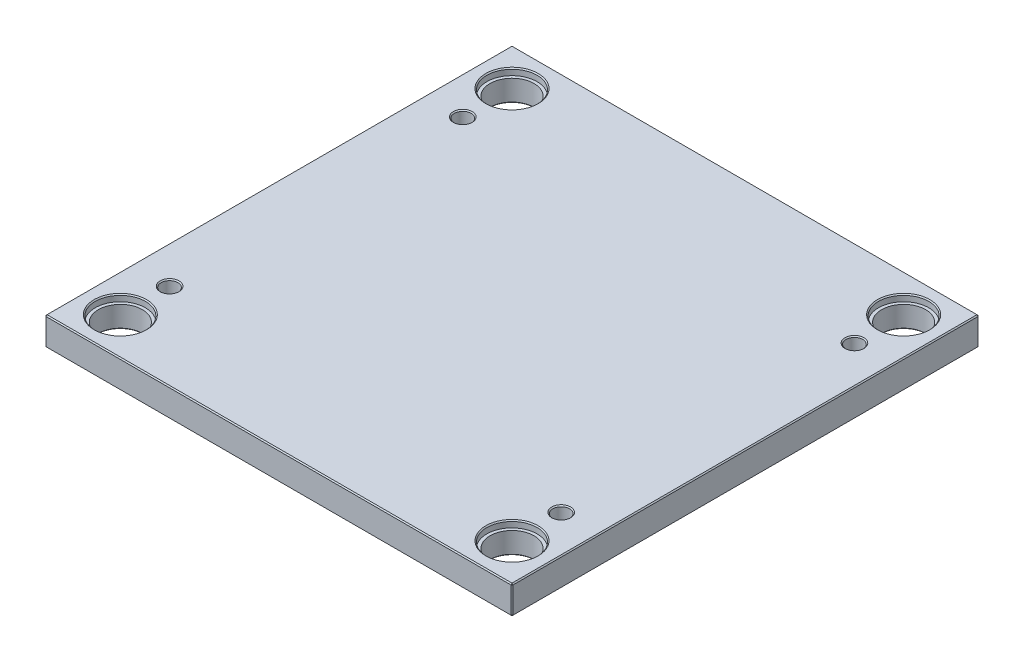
ISO-10303-21;
HEADER;
FILE_DESCRIPTION(('STEP AP214'),'2;1');
FILE_NAME('part.step','',(''),(''),'','','');
FILE_SCHEMA(('AUTOMOTIVE_DESIGN { 1 0 10303 214 1 1 1 1 }'));
ENDSEC;
DATA;
#1=APPLICATION_CONTEXT('core data for automotive mechanical design processes');
#2=APPLICATION_PROTOCOL_DEFINITION('international standard','automotive_design',2000,#1);
#3=PRODUCT_CONTEXT('',#1,'mechanical');
#4=PRODUCT('Part','Part','',(#3));
#5=PRODUCT_RELATED_PRODUCT_CATEGORY('part','',(#4));
#6=PRODUCT_DEFINITION_FORMATION('','',#4);
#7=PRODUCT_DEFINITION_CONTEXT('part definition',#1,'design');
#8=PRODUCT_DEFINITION('design','',#6,#7);
#9=PRODUCT_DEFINITION_SHAPE('','',#8);
#10=(LENGTH_UNIT() NAMED_UNIT(*) SI_UNIT(.MILLI.,.METRE.));
#11=(NAMED_UNIT(*) PLANE_ANGLE_UNIT() SI_UNIT($,.RADIAN.));
#12=(NAMED_UNIT(*) SI_UNIT($,.STERADIAN.) SOLID_ANGLE_UNIT());
#13=UNCERTAINTY_MEASURE_WITH_UNIT(LENGTH_MEASURE(1.E-05),#10,'distance_accuracy_value','');
#14=(GEOMETRIC_REPRESENTATION_CONTEXT(3) GLOBAL_UNCERTAINTY_ASSIGNED_CONTEXT((#13)) GLOBAL_UNIT_ASSIGNED_CONTEXT((#10,
#11,#12)) REPRESENTATION_CONTEXT('',''));
#15=CARTESIAN_POINT('',(0.,0.,0.));
#16=DIRECTION('',(0.,0.,1.));
#17=DIRECTION('',(1.,0.,0.));
#18=AXIS2_PLACEMENT_3D('',#15,#16,#17);
#19=CARTESIAN_POINT('',(-187.,0.,-187.));
#20=DIRECTION('',(0.,1.,0.));
#21=DIRECTION('',(0.,0.,1.));
#22=AXIS2_PLACEMENT_3D('',#19,#20,#21);
#23=CYLINDRICAL_SURFACE('',#22,21.);
#24=CARTESIAN_POINT('',(-187.,1.00000000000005,-187.));
#25=DIRECTION('',(0.,1.,0.));
#26=DIRECTION('',(0.,0.,1.));
#27=AXIS2_PLACEMENT_3D('',#24,#25,#26);
#28=CIRCLE('',#27,21.);
#29=CARTESIAN_POINT('',(-187.,1.00000000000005,-166.));
#30=VERTEX_POINT('',#29);
#31=EDGE_CURVE('E472',#30,#30,#28,.F.);
#32=ORIENTED_EDGE('',*,*,#31,.T.);
#33=EDGE_LOOP('',(#32));
#34=FACE_BOUND('',#33,.T.);
#35=CARTESIAN_POINT('',(-187.,20.7,-187.));
#36=DIRECTION('',(0.,1.,0.));
#37=DIRECTION('',(0.,0.,1.));
#38=AXIS2_PLACEMENT_3D('',#35,#36,#37);
#39=CIRCLE('',#38,21.);
#40=CARTESIAN_POINT('',(-187.,20.7,-166.));
#41=VERTEX_POINT('',#40);
#42=EDGE_CURVE('E221',#41,#41,#39,.F.);
#43=ORIENTED_EDGE('',*,*,#42,.F.);
#44=EDGE_LOOP('',(#43));
#45=FACE_BOUND('',#44,.T.);
#46=ADVANCED_FACE('F16',(#34,#45),#23,.F.);
#47=CARTESIAN_POINT('',(187.,0.,-187.));
#48=DIRECTION('',(0.,1.,0.));
#49=DIRECTION('',(0.,0.,1.));
#50=AXIS2_PLACEMENT_3D('',#47,#48,#49);
#51=CYLINDRICAL_SURFACE('',#50,21.);
#52=CARTESIAN_POINT('',(187.,1.00000000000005,-187.));
#53=DIRECTION('',(0.,1.,0.));
#54=DIRECTION('',(0.,0.,1.));
#55=AXIS2_PLACEMENT_3D('',#52,#53,#54);
#56=CIRCLE('',#55,21.);
#57=CARTESIAN_POINT('',(187.,1.00000000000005,-166.));
#58=VERTEX_POINT('',#57);
#59=EDGE_CURVE('E474',#58,#58,#56,.F.);
#60=ORIENTED_EDGE('',*,*,#59,.T.);
#61=EDGE_LOOP('',(#60));
#62=FACE_BOUND('',#61,.T.);
#63=CARTESIAN_POINT('',(187.,20.7,-187.));
#64=DIRECTION('',(0.,1.,0.));
#65=DIRECTION('',(0.,0.,1.));
#66=AXIS2_PLACEMENT_3D('',#63,#64,#65);
#67=CIRCLE('',#66,21.);
#68=CARTESIAN_POINT('',(187.,20.7,-166.));
#69=VERTEX_POINT('',#68);
#70=EDGE_CURVE('E218',#69,#69,#67,.F.);
#71=ORIENTED_EDGE('',*,*,#70,.F.);
#72=EDGE_LOOP('',(#71));
#73=FACE_BOUND('',#72,.T.);
#74=ADVANCED_FACE('F263',(#62,#73),#51,.F.);
#75=CARTESIAN_POINT('',(187.,0.,187.));
#76=DIRECTION('',(0.,1.,0.));
#77=DIRECTION('',(0.,0.,1.));
#78=AXIS2_PLACEMENT_3D('',#75,#76,#77);
#79=CYLINDRICAL_SURFACE('',#78,21.);
#80=CARTESIAN_POINT('',(187.,1.00000000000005,187.));
#81=DIRECTION('',(0.,1.,0.));
#82=DIRECTION('',(0.,0.,1.));
#83=AXIS2_PLACEMENT_3D('',#80,#81,#82);
#84=CIRCLE('',#83,21.);
#85=CARTESIAN_POINT('',(187.,1.00000000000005,208.));
#86=VERTEX_POINT('',#85);
#87=EDGE_CURVE('E477',#86,#86,#84,.F.);
#88=ORIENTED_EDGE('',*,*,#87,.T.);
#89=EDGE_LOOP('',(#88));
#90=FACE_BOUND('',#89,.T.);
#91=CARTESIAN_POINT('',(187.,20.7,187.));
#92=DIRECTION('',(0.,1.,0.));
#93=DIRECTION('',(0.,0.,1.));
#94=AXIS2_PLACEMENT_3D('',#91,#92,#93);
#95=CIRCLE('',#94,21.);
#96=CARTESIAN_POINT('',(187.,20.7,208.));
#97=VERTEX_POINT('',#96);
#98=EDGE_CURVE('E214',#97,#97,#95,.F.);
#99=ORIENTED_EDGE('',*,*,#98,.F.);
#100=EDGE_LOOP('',(#99));
#101=FACE_BOUND('',#100,.T.);
#102=ADVANCED_FACE('F270',(#90,#101),#79,.F.);
#103=CARTESIAN_POINT('',(-187.,0.,187.));
#104=DIRECTION('',(0.,1.,0.));
#105=DIRECTION('',(0.,0.,1.));
#106=AXIS2_PLACEMENT_3D('',#103,#104,#105);
#107=CYLINDRICAL_SURFACE('',#106,21.);
#108=CARTESIAN_POINT('',(-187.,1.00000000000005,187.));
#109=DIRECTION('',(0.,1.,0.));
#110=DIRECTION('',(0.,0.,1.));
#111=AXIS2_PLACEMENT_3D('',#108,#109,#110);
#112=CIRCLE('',#111,21.);
#113=CARTESIAN_POINT('',(-187.,1.00000000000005,208.));
#114=VERTEX_POINT('',#113);
#115=EDGE_CURVE('E480',#114,#114,#112,.F.);
#116=ORIENTED_EDGE('',*,*,#115,.T.);
#117=EDGE_LOOP('',(#116));
#118=FACE_BOUND('',#117,.T.);
#119=CARTESIAN_POINT('',(-187.,20.7,187.));
#120=DIRECTION('',(0.,1.,0.));
#121=DIRECTION('',(0.,0.,1.));
#122=AXIS2_PLACEMENT_3D('',#119,#120,#121);
#123=CIRCLE('',#122,21.);
#124=CARTESIAN_POINT('',(-187.,20.7,208.));
#125=VERTEX_POINT('',#124);
#126=EDGE_CURVE('E211',#125,#125,#123,.F.);
#127=ORIENTED_EDGE('',*,*,#126,.F.);
#128=EDGE_LOOP('',(#127));
#129=FACE_BOUND('',#128,.T.);
#130=ADVANCED_FACE('F277',(#118,#129),#107,.F.);
#131=CARTESIAN_POINT('',(-223.,27.,223.));
#132=DIRECTION('',(1.,0.,0.));
#133=DIRECTION('',(0.,0.,-1.));
#134=AXIS2_PLACEMENT_3D('',#131,#132,#133);
#135=PLANE('',#134);
#136=DIRECTION('',(0.,-1.,0.));
#137=VECTOR('',#136,1.);
#138=CARTESIAN_POINT('',(-223.,27.,-222.));
#139=LINE('',#138,#137);
#140=CARTESIAN_POINT('',(-223.,26.,-222.));
#141=VERTEX_POINT('',#140);
#142=CARTESIAN_POINT('',(-223.,1.00000000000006,-222.));
#143=VERTEX_POINT('',#142);
#144=EDGE_CURVE('E487',#141,#143,#139,.T.);
#145=ORIENTED_EDGE('',*,*,#144,.T.);
#146=DIRECTION('',(0.,0.,1.));
#147=VECTOR('',#146,1.);
#148=CARTESIAN_POINT('',(-223.,1.00000000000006,223.));
#149=LINE('',#148,#147);
#150=CARTESIAN_POINT('',(-223.,1.00000000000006,222.));
#151=VERTEX_POINT('',#150);
#152=EDGE_CURVE('E490',#143,#151,#149,.T.);
#153=ORIENTED_EDGE('',*,*,#152,.T.);
#154=DIRECTION('',(0.,1.,0.));
#155=VECTOR('',#154,1.);
#156=CARTESIAN_POINT('',(-223.,27.,222.));
#157=LINE('',#156,#155);
#158=CARTESIAN_POINT('',(-223.,26.,222.));
#159=VERTEX_POINT('',#158);
#160=EDGE_CURVE('E485',#151,#159,#157,.T.);
#161=ORIENTED_EDGE('',*,*,#160,.T.);
#162=DIRECTION('',(0.,0.,-1.));
#163=VECTOR('',#162,1.);
#164=CARTESIAN_POINT('',(-223.,26.,-223.));
#165=LINE('',#164,#163);
#166=EDGE_CURVE('E483',#159,#141,#165,.T.);
#167=ORIENTED_EDGE('',*,*,#166,.T.);
#168=EDGE_LOOP('',(#145,#153,#161,#167));
#169=FACE_BOUND('',#168,.T.);
#170=ADVANCED_FACE('F298',(#169),#135,.F.);
#171=CARTESIAN_POINT('',(223.,27.,223.));
#172=DIRECTION('',(0.,0.,-1.));
#173=DIRECTION('',(-1.,0.,0.));
#174=AXIS2_PLACEMENT_3D('',#171,#172,#173);
#175=PLANE('',#174);
#176=DIRECTION('',(-1.,0.,0.));
#177=VECTOR('',#176,1.);
#178=CARTESIAN_POINT('',(-223.,26.,223.));
#179=LINE('',#178,#177);
#180=CARTESIAN_POINT('',(222.,26.,223.));
#181=VERTEX_POINT('',#180);
#182=CARTESIAN_POINT('',(-222.,26.,223.));
#183=VERTEX_POINT('',#182);
#184=EDGE_CURVE('E509',#181,#183,#179,.T.);
#185=ORIENTED_EDGE('',*,*,#184,.T.);
#186=DIRECTION('',(0.,-1.,0.));
#187=VECTOR('',#186,1.);
#188=CARTESIAN_POINT('',(-222.,27.,223.));
#189=LINE('',#188,#187);
#190=CARTESIAN_POINT('',(-222.,1.,223.));
#191=VERTEX_POINT('',#190);
#192=EDGE_CURVE('E515',#183,#191,#189,.T.);
#193=ORIENTED_EDGE('',*,*,#192,.T.);
#194=DIRECTION('',(1.,0.,0.));
#195=VECTOR('',#194,1.);
#196=CARTESIAN_POINT('',(223.,1.,223.));
#197=LINE('',#196,#195);
#198=CARTESIAN_POINT('',(222.,1.,223.));
#199=VERTEX_POINT('',#198);
#200=EDGE_CURVE('E513',#191,#199,#197,.T.);
#201=ORIENTED_EDGE('',*,*,#200,.T.);
#202=DIRECTION('',(0.,1.,0.));
#203=VECTOR('',#202,1.);
#204=CARTESIAN_POINT('',(222.,27.,223.));
#205=LINE('',#204,#203);
#206=EDGE_CURVE('E511',#199,#181,#205,.T.);
#207=ORIENTED_EDGE('',*,*,#206,.T.);
#208=EDGE_LOOP('',(#185,#193,#201,#207));
#209=FACE_BOUND('',#208,.T.);
#210=ADVANCED_FACE('F294',(#209),#175,.F.);
#211=CARTESIAN_POINT('',(223.,27.,223.));
#212=DIRECTION('',(-1.,0.,0.));
#213=DIRECTION('',(0.,0.,1.));
#214=AXIS2_PLACEMENT_3D('',#211,#212,#213);
#215=PLANE('',#214);
#216=DIRECTION('',(0.,0.,-1.));
#217=VECTOR('',#216,1.);
#218=CARTESIAN_POINT('',(223.,1.,223.));
#219=LINE('',#218,#217);
#220=CARTESIAN_POINT('',(223.,1.,222.));
#221=VERTEX_POINT('',#220);
#222=CARTESIAN_POINT('',(223.,1.,-222.));
#223=VERTEX_POINT('',#222);
#224=EDGE_CURVE('E504',#221,#223,#219,.T.);
#225=ORIENTED_EDGE('',*,*,#224,.T.);
#226=DIRECTION('',(0.,1.,0.));
#227=VECTOR('',#226,1.);
#228=CARTESIAN_POINT('',(223.,27.,-222.));
#229=LINE('',#228,#227);
#230=CARTESIAN_POINT('',(223.,26.,-222.));
#231=VERTEX_POINT('',#230);
#232=EDGE_CURVE('E506',#223,#231,#229,.T.);
#233=ORIENTED_EDGE('',*,*,#232,.T.);
#234=DIRECTION('',(0.,0.,1.));
#235=VECTOR('',#234,1.);
#236=CARTESIAN_POINT('',(223.,26.,223.));
#237=LINE('',#236,#235);
#238=CARTESIAN_POINT('',(223.,26.,222.));
#239=VERTEX_POINT('',#238);
#240=EDGE_CURVE('E500',#231,#239,#237,.T.);
#241=ORIENTED_EDGE('',*,*,#240,.T.);
#242=DIRECTION('',(0.,-1.,0.));
#243=VECTOR('',#242,1.);
#244=CARTESIAN_POINT('',(223.,27.,222.));
#245=LINE('',#244,#243);
#246=EDGE_CURVE('E502',#239,#221,#245,.T.);
#247=ORIENTED_EDGE('',*,*,#246,.T.);
#248=EDGE_LOOP('',(#225,#233,#241,#247));
#249=FACE_BOUND('',#248,.T.);
#250=ADVANCED_FACE('F290',(#249),#215,.F.);
#251=CARTESIAN_POINT('',(223.,27.,-223.));
#252=DIRECTION('',(0.,0.,1.));
#253=DIRECTION('',(1.,0.,0.));
#254=AXIS2_PLACEMENT_3D('',#251,#252,#253);
#255=PLANE('',#254);
#256=DIRECTION('',(0.,-1.,0.));
#257=VECTOR('',#256,1.);
#258=CARTESIAN_POINT('',(222.,27.,-223.));
#259=LINE('',#258,#257);
#260=CARTESIAN_POINT('',(222.,26.,-223.));
#261=VERTEX_POINT('',#260);
#262=CARTESIAN_POINT('',(222.,1.,-223.));
#263=VERTEX_POINT('',#262);
#264=EDGE_CURVE('E494',#261,#263,#259,.T.);
#265=ORIENTED_EDGE('',*,*,#264,.T.);
#266=DIRECTION('',(-1.,0.,0.));
#267=VECTOR('',#266,1.);
#268=CARTESIAN_POINT('',(223.,1.,-223.));
#269=LINE('',#268,#267);
#270=CARTESIAN_POINT('',(-222.,1.,-223.));
#271=VERTEX_POINT('',#270);
#272=EDGE_CURVE('E138',#263,#271,#269,.T.);
#273=ORIENTED_EDGE('',*,*,#272,.T.);
#274=DIRECTION('',(0.,1.,0.));
#275=VECTOR('',#274,1.);
#276=CARTESIAN_POINT('',(-222.,27.,-223.));
#277=LINE('',#276,#275);
#278=CARTESIAN_POINT('',(-222.,26.,-223.));
#279=VERTEX_POINT('',#278);
#280=EDGE_CURVE('E496',#271,#279,#277,.T.);
#281=ORIENTED_EDGE('',*,*,#280,.T.);
#282=DIRECTION('',(1.,0.,0.));
#283=VECTOR('',#282,1.);
#284=CARTESIAN_POINT('',(223.,26.,-223.));
#285=LINE('',#284,#283);
#286=EDGE_CURVE('E492',#279,#261,#285,.T.);
#287=ORIENTED_EDGE('',*,*,#286,.T.);
#288=EDGE_LOOP('',(#265,#273,#281,#287));
#289=FACE_BOUND('',#288,.T.);
#290=ADVANCED_FACE('F282',(#289),#255,.F.);
#291=CARTESIAN_POINT('',(0.,27.,0.));
#292=DIRECTION('',(0.,1.,0.));
#293=DIRECTION('',(0.,0.,1.));
#294=AXIS2_PLACEMENT_3D('',#291,#292,#293);
#295=PLANE('',#294);
#296=CARTESIAN_POINT('',(187.,27.,187.));
#297=DIRECTION('',(0.,1.,0.));
#298=DIRECTION('',(0.,0.,1.));
#299=AXIS2_PLACEMENT_3D('',#296,#297,#298);
#300=CIRCLE('',#299,25.);
#301=CARTESIAN_POINT('',(187.,27.,212.));
#302=VERTEX_POINT('',#301);
#303=EDGE_CURVE('E236',#302,#302,#300,.F.);
#304=ORIENTED_EDGE('',*,*,#303,.T.);
#305=EDGE_LOOP('',(#304));
#306=FACE_BOUND('',#305,.T.);
#307=CARTESIAN_POINT('',(-187.,27.,187.));
#308=DIRECTION('',(0.,1.,0.));
#309=DIRECTION('',(0.,0.,1.));
#310=AXIS2_PLACEMENT_3D('',#307,#308,#309);
#311=CIRCLE('',#310,25.);
#312=CARTESIAN_POINT('',(-187.,27.,212.));
#313=VERTEX_POINT('',#312);
#314=EDGE_CURVE('E233',#313,#313,#311,.F.);
#315=ORIENTED_EDGE('',*,*,#314,.T.);
#316=EDGE_LOOP('',(#315));
#317=FACE_BOUND('',#316,.T.);
#318=CARTESIAN_POINT('',(187.,27.,-187.));
#319=DIRECTION('',(0.,1.,0.));
#320=DIRECTION('',(0.,0.,1.));
#321=AXIS2_PLACEMENT_3D('',#318,#319,#320);
#322=CIRCLE('',#321,25.);
#323=CARTESIAN_POINT('',(187.,27.,-162.));
#324=VERTEX_POINT('',#323);
#325=EDGE_CURVE('E230',#324,#324,#322,.F.);
#326=ORIENTED_EDGE('',*,*,#325,.T.);
#327=EDGE_LOOP('',(#326));
#328=FACE_BOUND('',#327,.T.);
#329=CARTESIAN_POINT('',(-187.,27.,-187.));
#330=DIRECTION('',(0.,1.,0.));
#331=DIRECTION('',(0.,0.,1.));
#332=AXIS2_PLACEMENT_3D('',#329,#330,#331);
#333=CIRCLE('',#332,25.);
#334=CARTESIAN_POINT('',(-187.,27.,-162.));
#335=VERTEX_POINT('',#334);
#336=EDGE_CURVE('E227',#335,#335,#333,.F.);
#337=ORIENTED_EDGE('',*,*,#336,.T.);
#338=EDGE_LOOP('',(#337));
#339=FACE_BOUND('',#338,.T.);
#340=CARTESIAN_POINT('',(-187.,27.,140.));
#341=DIRECTION('',(0.,1.,0.));
#342=DIRECTION('',(0.,0.,1.));
#343=AXIS2_PLACEMENT_3D('',#340,#341,#342);
#344=CIRCLE('',#343,9.);
#345=CARTESIAN_POINT('',(-187.,27.,149.));
#346=VERTEX_POINT('',#345);
#347=EDGE_CURVE('E198',#346,#346,#344,.F.);
#348=ORIENTED_EDGE('',*,*,#347,.T.);
#349=EDGE_LOOP('',(#348));
#350=FACE_BOUND('',#349,.T.);
#351=CARTESIAN_POINT('',(187.,27.,140.));
#352=DIRECTION('',(0.,1.,0.));
#353=DIRECTION('',(0.,0.,1.));
#354=AXIS2_PLACEMENT_3D('',#351,#352,#353);
#355=CIRCLE('',#354,9.);
#356=CARTESIAN_POINT('',(187.,27.,149.));
#357=VERTEX_POINT('',#356);
#358=EDGE_CURVE('E195',#357,#357,#355,.F.);
#359=ORIENTED_EDGE('',*,*,#358,.T.);
#360=EDGE_LOOP('',(#359));
#361=FACE_BOUND('',#360,.T.);
#362=CARTESIAN_POINT('',(187.,27.,-140.));
#363=DIRECTION('',(0.,1.,0.));
#364=DIRECTION('',(0.,0.,1.));
#365=AXIS2_PLACEMENT_3D('',#362,#363,#364);
#366=CIRCLE('',#365,9.00000000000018);
#367=CARTESIAN_POINT('',(187.,27.,-131.));
#368=VERTEX_POINT('',#367);
#369=EDGE_CURVE('E192',#368,#368,#366,.F.);
#370=ORIENTED_EDGE('',*,*,#369,.T.);
#371=EDGE_LOOP('',(#370));
#372=FACE_BOUND('',#371,.T.);
#373=CARTESIAN_POINT('',(-187.,27.,-140.));
#374=DIRECTION('',(0.,1.,0.));
#375=DIRECTION('',(0.,0.,1.));
#376=AXIS2_PLACEMENT_3D('',#373,#374,#375);
#377=CIRCLE('',#376,9.);
#378=CARTESIAN_POINT('',(-187.,27.,-131.));
#379=VERTEX_POINT('',#378);
#380=EDGE_CURVE('E188',#379,#379,#377,.F.);
#381=ORIENTED_EDGE('',*,*,#380,.T.);
#382=EDGE_LOOP('',(#381));
#383=FACE_BOUND('',#382,.T.);
#384=DIRECTION('',(0.,0.,-1.));
#385=VECTOR('',#384,1.);
#386=CARTESIAN_POINT('',(222.,27.,-223.));
#387=LINE('',#386,#385);
#388=CARTESIAN_POINT('',(222.,27.,222.));
#389=VERTEX_POINT('',#388);
#390=CARTESIAN_POINT('',(222.,27.,-222.));
#391=VERTEX_POINT('',#390);
#392=EDGE_CURVE('E31',#389,#391,#387,.T.);
#393=ORIENTED_EDGE('',*,*,#392,.T.);
#394=DIRECTION('',(-1.,0.,0.));
#395=VECTOR('',#394,1.);
#396=CARTESIAN_POINT('',(-223.,27.,-222.));
#397=LINE('',#396,#395);
#398=CARTESIAN_POINT('',(-222.,27.,-222.));
#399=VERTEX_POINT('',#398);
#400=EDGE_CURVE('E189',#391,#399,#397,.T.);
#401=ORIENTED_EDGE('',*,*,#400,.T.);
#402=DIRECTION('',(0.,0.,1.));
#403=VECTOR('',#402,1.);
#404=CARTESIAN_POINT('',(-222.,27.,223.));
#405=LINE('',#404,#403);
#406=CARTESIAN_POINT('',(-222.,27.,222.));
#407=VERTEX_POINT('',#406);
#408=EDGE_CURVE('E518',#399,#407,#405,.T.);
#409=ORIENTED_EDGE('',*,*,#408,.T.);
#410=DIRECTION('',(1.,0.,0.));
#411=VECTOR('',#410,1.);
#412=CARTESIAN_POINT('',(223.,27.,222.));
#413=LINE('',#412,#411);
#414=EDGE_CURVE('E36',#407,#389,#413,.T.);
#415=ORIENTED_EDGE('',*,*,#414,.T.);
#416=EDGE_LOOP('',(#393,#401,#409,#415));
#417=FACE_BOUND('',#416,.T.);
#418=ADVANCED_FACE('F279',(#306,#317,#328,#339,#350,#361,#372,#383,#417),#295,.T.);
#419=CARTESIAN_POINT('',(0.,0.,0.));
#420=DIRECTION('',(0.,1.,0.));
#421=DIRECTION('',(0.,0.,1.));
#422=AXIS2_PLACEMENT_3D('',#419,#420,#421);
#423=PLANE('',#422);
#424=CARTESIAN_POINT('',(-187.,0.,-187.));
#425=DIRECTION('',(0.,1.,0.));
#426=DIRECTION('',(0.,0.,1.));
#427=AXIS2_PLACEMENT_3D('',#424,#425,#426);
#428=CIRCLE('',#427,22.);
#429=CARTESIAN_POINT('',(-187.,0.,-165.));
#430=VERTEX_POINT('',#429);
#431=EDGE_CURVE('E469',#430,#430,#428,.T.);
#432=ORIENTED_EDGE('',*,*,#431,.T.);
#433=EDGE_LOOP('',(#432));
#434=FACE_BOUND('',#433,.T.);
#435=CARTESIAN_POINT('',(187.,0.,-187.));
#436=DIRECTION('',(0.,1.,0.));
#437=DIRECTION('',(0.,0.,1.));
#438=AXIS2_PLACEMENT_3D('',#435,#436,#437);
#439=CIRCLE('',#438,22.);
#440=CARTESIAN_POINT('',(187.,0.,-165.));
#441=VERTEX_POINT('',#440);
#442=EDGE_CURVE('E466',#441,#441,#439,.T.);
#443=ORIENTED_EDGE('',*,*,#442,.T.);
#444=EDGE_LOOP('',(#443));
#445=FACE_BOUND('',#444,.T.);
#446=CARTESIAN_POINT('',(187.,0.,187.));
#447=DIRECTION('',(0.,1.,0.));
#448=DIRECTION('',(0.,0.,1.));
#449=AXIS2_PLACEMENT_3D('',#446,#447,#448);
#450=CIRCLE('',#449,22.);
#451=CARTESIAN_POINT('',(187.,0.,209.));
#452=VERTEX_POINT('',#451);
#453=EDGE_CURVE('E463',#452,#452,#450,.T.);
#454=ORIENTED_EDGE('',*,*,#453,.T.);
#455=EDGE_LOOP('',(#454));
#456=FACE_BOUND('',#455,.T.);
#457=CARTESIAN_POINT('',(-187.,0.,187.));
#458=DIRECTION('',(0.,1.,0.));
#459=DIRECTION('',(0.,0.,1.));
#460=AXIS2_PLACEMENT_3D('',#457,#458,#459);
#461=CIRCLE('',#460,22.);
#462=CARTESIAN_POINT('',(-187.,0.,209.));
#463=VERTEX_POINT('',#462);
#464=EDGE_CURVE('E460',#463,#463,#461,.T.);
#465=ORIENTED_EDGE('',*,*,#464,.T.);
#466=EDGE_LOOP('',(#465));
#467=FACE_BOUND('',#466,.T.);
#468=DIRECTION('',(0.,0.,1.));
#469=VECTOR('',#468,1.);
#470=CARTESIAN_POINT('',(222.,0.,0.));
#471=LINE('',#470,#469);
#472=CARTESIAN_POINT('',(222.,0.,-222.));
#473=VERTEX_POINT('',#472);
#474=CARTESIAN_POINT('',(222.,0.,222.));
#475=VERTEX_POINT('',#474);
#476=EDGE_CURVE('E108',#473,#475,#471,.T.);
#477=ORIENTED_EDGE('',*,*,#476,.T.);
#478=DIRECTION('',(-1.,0.,0.));
#479=VECTOR('',#478,1.);
#480=CARTESIAN_POINT('',(0.,0.,222.));
#481=LINE('',#480,#479);
#482=CARTESIAN_POINT('',(-222.,0.,222.));
#483=VERTEX_POINT('',#482);
#484=EDGE_CURVE('E458',#475,#483,#481,.T.);
#485=ORIENTED_EDGE('',*,*,#484,.T.);
#486=DIRECTION('',(0.,0.,-1.));
#487=VECTOR('',#486,1.);
#488=CARTESIAN_POINT('',(-222.,0.,0.));
#489=LINE('',#488,#487);
#490=CARTESIAN_POINT('',(-222.,0.,-222.));
#491=VERTEX_POINT('',#490);
#492=EDGE_CURVE('E110',#483,#491,#489,.T.);
#493=ORIENTED_EDGE('',*,*,#492,.T.);
#494=DIRECTION('',(1.,0.,0.));
#495=VECTOR('',#494,1.);
#496=CARTESIAN_POINT('',(0.,0.,-222.));
#497=LINE('',#496,#495);
#498=EDGE_CURVE('E104',#491,#473,#497,.T.);
#499=ORIENTED_EDGE('',*,*,#498,.T.);
#500=EDGE_LOOP('',(#477,#485,#493,#499));
#501=FACE_BOUND('',#500,.T.);
#502=ADVANCED_FACE('F106',(#434,#445,#456,#467,#501),#423,.F.);
#503=CARTESIAN_POINT('',(-187.,0.,-187.));
#504=DIRECTION('',(0.,-1.,0.));
#505=DIRECTION('',(0.,0.,-1.));
#506=AXIS2_PLACEMENT_3D('',#503,#504,#505);
#507=CONICAL_SURFACE('',#506,22.,0.785398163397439);
#508=ORIENTED_EDGE('',*,*,#31,.F.);
#509=EDGE_LOOP('',(#508));
#510=FACE_BOUND('',#509,.T.);
#511=ORIENTED_EDGE('',*,*,#431,.F.);
#512=EDGE_LOOP('',(#511));
#513=FACE_BOUND('',#512,.T.);
#514=ADVANCED_FACE('F286',(#510,#513),#507,.F.);
#515=CARTESIAN_POINT('',(187.,0.,-187.));
#516=DIRECTION('',(0.,-1.,0.));
#517=DIRECTION('',(0.,0.,-1.));
#518=AXIS2_PLACEMENT_3D('',#515,#516,#517);
#519=CONICAL_SURFACE('',#518,22.,0.785398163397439);
#520=ORIENTED_EDGE('',*,*,#59,.F.);
#521=EDGE_LOOP('',(#520));
#522=FACE_BOUND('',#521,.T.);
#523=ORIENTED_EDGE('',*,*,#442,.F.);
#524=EDGE_LOOP('',(#523));
#525=FACE_BOUND('',#524,.T.);
#526=ADVANCED_FACE('F305',(#522,#525),#519,.F.);
#527=CARTESIAN_POINT('',(187.,0.,187.));
#528=DIRECTION('',(0.,-1.,0.));
#529=DIRECTION('',(0.,0.,-1.));
#530=AXIS2_PLACEMENT_3D('',#527,#528,#529);
#531=CONICAL_SURFACE('',#530,22.,0.785398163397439);
#532=ORIENTED_EDGE('',*,*,#87,.F.);
#533=EDGE_LOOP('',(#532));
#534=FACE_BOUND('',#533,.T.);
#535=ORIENTED_EDGE('',*,*,#453,.F.);
#536=EDGE_LOOP('',(#535));
#537=FACE_BOUND('',#536,.T.);
#538=ADVANCED_FACE('F309',(#534,#537),#531,.F.);
#539=CARTESIAN_POINT('',(-187.,0.,187.));
#540=DIRECTION('',(0.,-1.,0.));
#541=DIRECTION('',(0.,0.,-1.));
#542=AXIS2_PLACEMENT_3D('',#539,#540,#541);
#543=CONICAL_SURFACE('',#542,22.,0.785398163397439);
#544=ORIENTED_EDGE('',*,*,#115,.F.);
#545=EDGE_LOOP('',(#544));
#546=FACE_BOUND('',#545,.T.);
#547=ORIENTED_EDGE('',*,*,#464,.F.);
#548=EDGE_LOOP('',(#547));
#549=FACE_BOUND('',#548,.T.);
#550=ADVANCED_FACE('F313',(#546,#549),#543,.F.);
#551=CARTESIAN_POINT('',(223.,27.,222.));
#552=DIRECTION('',(-0.707106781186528,0.,-0.707106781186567));
#553=DIRECTION('',(0.,-1.,0.));
#554=AXIS2_PLACEMENT_3D('',#551,#552,#553);
#555=PLANE('',#554);
#556=DIRECTION('',(-0.707106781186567,0.,0.707106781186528));
#557=VECTOR('',#556,1.);
#558=CARTESIAN_POINT('',(222.,26.,223.));
#559=LINE('',#558,#557);
#560=EDGE_CURVE('E126',#181,#239,#559,.F.);
#561=ORIENTED_EDGE('',*,*,#560,.F.);
#562=ORIENTED_EDGE('',*,*,#206,.F.);
#563=DIRECTION('',(0.707106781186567,0.,-0.707106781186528));
#564=VECTOR('',#563,1.);
#565=CARTESIAN_POINT('',(222.,1.,223.));
#566=LINE('',#565,#564);
#567=EDGE_CURVE('E180',#221,#199,#566,.F.);
#568=ORIENTED_EDGE('',*,*,#567,.F.);
#569=ORIENTED_EDGE('',*,*,#246,.F.);
#570=EDGE_LOOP('',(#561,#562,#568,#569));
#571=FACE_BOUND('',#570,.T.);
#572=ADVANCED_FACE('F317',(#571),#555,.F.);
#573=CARTESIAN_POINT('',(222.,26.,223.));
#574=DIRECTION('',(0.577350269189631,0.577350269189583,0.577350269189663));
#575=DIRECTION('',(0.707106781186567,0.,-0.707106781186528));
#576=AXIS2_PLACEMENT_3D('',#573,#574,#575);
#577=PLANE('',#576);
#578=DIRECTION('',(0.,-0.707106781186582,0.707106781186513));
#579=VECTOR('',#578,1.);
#580=CARTESIAN_POINT('',(222.,26.,223.));
#581=LINE('',#580,#579);
#582=EDGE_CURVE('E175',#181,#389,#581,.F.);
#583=ORIENTED_EDGE('',*,*,#582,.F.);
#584=ORIENTED_EDGE('',*,*,#560,.T.);
#585=DIRECTION('',(-0.707106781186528,0.707106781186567,0.));
#586=VECTOR('',#585,1.);
#587=CARTESIAN_POINT('',(222.5,26.5,222.));
#588=LINE('',#587,#586);
#589=EDGE_CURVE('E177',#389,#239,#588,.F.);
#590=ORIENTED_EDGE('',*,*,#589,.F.);
#591=EDGE_LOOP('',(#583,#584,#590));
#592=FACE_BOUND('',#591,.T.);
#593=ADVANCED_FACE('F385',(#592),#577,.T.);
#594=CARTESIAN_POINT('',(222.,1.,223.));
#595=DIRECTION('',(0.577350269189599,-0.577350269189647,0.577350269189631));
#596=DIRECTION('',(0.,-0.707106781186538,-0.707106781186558));
#597=AXIS2_PLACEMENT_3D('',#594,#595,#596);
#598=PLANE('',#597);
#599=DIRECTION('',(-0.707106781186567,-0.707106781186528,0.));
#600=VECTOR('',#599,1.);
#601=CARTESIAN_POINT('',(222.5,0.499999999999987,222.));
#602=LINE('',#601,#600);
#603=EDGE_CURVE('E124',#221,#475,#602,.T.);
#604=ORIENTED_EDGE('',*,*,#603,.F.);
#605=ORIENTED_EDGE('',*,*,#567,.T.);
#606=DIRECTION('',(0.,0.707106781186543,0.707106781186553));
#607=VECTOR('',#606,1.);
#608=CARTESIAN_POINT('',(222.,1.,223.));
#609=LINE('',#608,#607);
#610=EDGE_CURVE('E172',#475,#199,#609,.T.);
#611=ORIENTED_EDGE('',*,*,#610,.F.);
#612=EDGE_LOOP('',(#604,#605,#611));
#613=FACE_BOUND('',#612,.T.);
#614=ADVANCED_FACE('F381',(#613),#598,.T.);
#615=CARTESIAN_POINT('',(222.,27.,0.));
#616=DIRECTION('',(0.707106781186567,0.707106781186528,0.));
#617=DIRECTION('',(0.,0.,1.));
#618=AXIS2_PLACEMENT_3D('',#615,#616,#617);
#619=PLANE('',#618);
#620=ORIENTED_EDGE('',*,*,#589,.T.);
#621=ORIENTED_EDGE('',*,*,#240,.F.);
#622=DIRECTION('',(0.707106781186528,-0.707106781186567,0.));
#623=VECTOR('',#622,1.);
#624=CARTESIAN_POINT('',(223.,26.,-222.));
#625=LINE('',#624,#623);
#626=EDGE_CURVE('E166',#391,#231,#625,.T.);
#627=ORIENTED_EDGE('',*,*,#626,.F.);
#628=ORIENTED_EDGE('',*,*,#392,.F.);
#629=EDGE_LOOP('',(#620,#621,#627,#628));
#630=FACE_BOUND('',#629,.T.);
#631=ADVANCED_FACE('F377',(#630),#619,.T.);
#632=CARTESIAN_POINT('',(0.,27.,222.));
#633=DIRECTION('',(0.,0.707106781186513,0.707106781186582));
#634=DIRECTION('',(-1.,0.,0.));
#635=AXIS2_PLACEMENT_3D('',#632,#633,#634);
#636=PLANE('',#635);
#637=ORIENTED_EDGE('',*,*,#582,.T.);
#638=ORIENTED_EDGE('',*,*,#414,.F.);
#639=DIRECTION('',(0.,0.707106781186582,-0.707106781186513));
#640=VECTOR('',#639,1.);
#641=CARTESIAN_POINT('',(-222.,26.5,222.5));
#642=LINE('',#641,#640);
#643=EDGE_CURVE('E163',#183,#407,#642,.T.);
#644=ORIENTED_EDGE('',*,*,#643,.F.);
#645=ORIENTED_EDGE('',*,*,#184,.F.);
#646=EDGE_LOOP('',(#637,#638,#644,#645));
#647=FACE_BOUND('',#646,.T.);
#648=ADVANCED_FACE('F373',(#647),#636,.T.);
#649=CARTESIAN_POINT('',(-222.,27.,223.));
#650=DIRECTION('',(0.707106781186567,0.,-0.707106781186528));
#651=DIRECTION('',(0.,-1.,0.));
#652=AXIS2_PLACEMENT_3D('',#649,#650,#651);
#653=PLANE('',#652);
#654=DIRECTION('',(0.707106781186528,0.,0.707106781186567));
#655=VECTOR('',#654,1.);
#656=CARTESIAN_POINT('',(-222.,1.,223.));
#657=LINE('',#656,#655);
#658=EDGE_CURVE('E157',#191,#151,#657,.F.);
#659=ORIENTED_EDGE('',*,*,#658,.F.);
#660=ORIENTED_EDGE('',*,*,#192,.F.);
#661=DIRECTION('',(-0.707106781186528,0.,-0.707106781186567));
#662=VECTOR('',#661,1.);
#663=CARTESIAN_POINT('',(-223.,26.,222.));
#664=LINE('',#663,#662);
#665=EDGE_CURVE('E160',#159,#183,#664,.F.);
#666=ORIENTED_EDGE('',*,*,#665,.F.);
#667=ORIENTED_EDGE('',*,*,#160,.F.);
#668=EDGE_LOOP('',(#659,#660,#666,#667));
#669=FACE_BOUND('',#668,.T.);
#670=ADVANCED_FACE('F369',(#669),#653,.F.);
#671=CARTESIAN_POINT('',(223.,1.,223.));
#672=DIRECTION('',(0.,0.707106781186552,-0.707106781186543));
#673=DIRECTION('',(1.,0.,0.));
#674=AXIS2_PLACEMENT_3D('',#671,#672,#673);
#675=PLANE('',#674);
#676=ORIENTED_EDGE('',*,*,#610,.T.);
#677=ORIENTED_EDGE('',*,*,#200,.F.);
#678=DIRECTION('',(0.,-0.707106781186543,-0.707106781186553));
#679=VECTOR('',#678,1.);
#680=CARTESIAN_POINT('',(-222.,1.,223.));
#681=LINE('',#680,#679);
#682=EDGE_CURVE('E135',#483,#191,#681,.F.);
#683=ORIENTED_EDGE('',*,*,#682,.F.);
#684=ORIENTED_EDGE('',*,*,#484,.F.);
#685=EDGE_LOOP('',(#676,#677,#683,#684));
#686=FACE_BOUND('',#685,.T.);
#687=ADVANCED_FACE('F366',(#686),#675,.F.);
#688=CARTESIAN_POINT('',(223.,1.,223.));
#689=DIRECTION('',(-0.707106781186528,0.707106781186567,0.));
#690=DIRECTION('',(0.,0.,-1.));
#691=AXIS2_PLACEMENT_3D('',#688,#689,#690);
#692=PLANE('',#691);
#693=ORIENTED_EDGE('',*,*,#603,.T.);
#694=ORIENTED_EDGE('',*,*,#476,.F.);
#695=DIRECTION('',(0.707106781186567,0.707106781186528,0.));
#696=VECTOR('',#695,1.);
#697=CARTESIAN_POINT('',(222.5,0.500000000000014,-222.));
#698=LINE('',#697,#696);
#699=EDGE_CURVE('E121',#223,#473,#698,.F.);
#700=ORIENTED_EDGE('',*,*,#699,.F.);
#701=ORIENTED_EDGE('',*,*,#224,.F.);
#702=EDGE_LOOP('',(#693,#694,#700,#701));
#703=FACE_BOUND('',#702,.T.);
#704=ADVANCED_FACE('F119',(#703),#692,.F.);
#705=CARTESIAN_POINT('',(222.,27.,-223.));
#706=DIRECTION('',(-0.707106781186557,0.,0.707106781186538));
#707=DIRECTION('',(0.,-1.,0.));
#708=AXIS2_PLACEMENT_3D('',#705,#706,#707);
#709=PLANE('',#708);
#710=DIRECTION('',(0.707106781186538,0.,0.707106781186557));
#711=VECTOR('',#710,1.);
#712=CARTESIAN_POINT('',(223.,26.,-222.));
#713=LINE('',#712,#711);
#714=EDGE_CURVE('E168',#231,#261,#713,.F.);
#715=ORIENTED_EDGE('',*,*,#714,.F.);
#716=ORIENTED_EDGE('',*,*,#232,.F.);
#717=DIRECTION('',(-0.707106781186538,0.,-0.707106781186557));
#718=VECTOR('',#717,1.);
#719=CARTESIAN_POINT('',(222.,1.,-223.));
#720=LINE('',#719,#718);
#721=EDGE_CURVE('E134',#263,#223,#720,.F.);
#722=ORIENTED_EDGE('',*,*,#721,.F.);
#723=ORIENTED_EDGE('',*,*,#264,.F.);
#724=EDGE_LOOP('',(#715,#716,#722,#723));
#725=FACE_BOUND('',#724,.T.);
#726=ADVANCED_FACE('F359',(#725),#709,.F.);
#727=CARTESIAN_POINT('',(223.,26.,-222.));
#728=DIRECTION('',(0.577350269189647,0.577350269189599,-0.577350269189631));
#729=DIRECTION('',(-0.707106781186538,0.,-0.707106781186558));
#730=AXIS2_PLACEMENT_3D('',#727,#728,#729);
#731=PLANE('',#730);
#732=ORIENTED_EDGE('',*,*,#626,.T.);
#733=ORIENTED_EDGE('',*,*,#714,.T.);
#734=DIRECTION('',(0.,0.707106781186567,0.707106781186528));
#735=VECTOR('',#734,1.);
#736=CARTESIAN_POINT('',(222.,26.5,-222.5));
#737=LINE('',#736,#735);
#738=EDGE_CURVE('E152',#391,#261,#737,.F.);
#739=ORIENTED_EDGE('',*,*,#738,.F.);
#740=EDGE_LOOP('',(#732,#733,#739));
#741=FACE_BOUND('',#740,.T.);
#742=ADVANCED_FACE('F355',(#741),#731,.T.);
#743=CARTESIAN_POINT('',(-223.,26.,222.));
#744=DIRECTION('',(-0.577350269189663,0.577350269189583,0.577350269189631));
#745=DIRECTION('',(0.707106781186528,0.,0.707106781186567));
#746=AXIS2_PLACEMENT_3D('',#743,#744,#745);
#747=PLANE('',#746);
#748=ORIENTED_EDGE('',*,*,#665,.T.);
#749=ORIENTED_EDGE('',*,*,#643,.T.);
#750=DIRECTION('',(-0.707106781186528,-0.707106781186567,0.));
#751=VECTOR('',#750,1.);
#752=CARTESIAN_POINT('',(-223.,26.,222.));
#753=LINE('',#752,#751);
#754=EDGE_CURVE('E143',#159,#407,#753,.F.);
#755=ORIENTED_EDGE('',*,*,#754,.F.);
#756=EDGE_LOOP('',(#748,#749,#755));
#757=FACE_BOUND('',#756,.T.);
#758=ADVANCED_FACE('F351',(#757),#747,.T.);
#759=CARTESIAN_POINT('',(-222.,1.,223.));
#760=DIRECTION('',(-0.577350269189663,-0.577350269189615,0.577350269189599));
#761=DIRECTION('',(0.707106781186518,-0.707106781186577,0.));
#762=AXIS2_PLACEMENT_3D('',#759,#760,#761);
#763=PLANE('',#762);
#764=ORIENTED_EDGE('',*,*,#682,.T.);
#765=ORIENTED_EDGE('',*,*,#658,.T.);
#766=DIRECTION('',(-0.707106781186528,0.707106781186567,0.));
#767=VECTOR('',#766,1.);
#768=CARTESIAN_POINT('',(-222.5,0.500000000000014,222.));
#769=LINE('',#768,#767);
#770=EDGE_CURVE('E139',#483,#151,#769,.T.);
#771=ORIENTED_EDGE('',*,*,#770,.F.);
#772=EDGE_LOOP('',(#764,#765,#771));
#773=FACE_BOUND('',#772,.T.);
#774=ADVANCED_FACE('F348',(#773),#763,.T.);
#775=CARTESIAN_POINT('',(222.,1.,-223.));
#776=DIRECTION('',(0.577350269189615,-0.577350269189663,-0.577350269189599));
#777=DIRECTION('',(0.707106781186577,0.707106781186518,0.));
#778=AXIS2_PLACEMENT_3D('',#775,#776,#777);
#779=PLANE('',#778);
#780=ORIENTED_EDGE('',*,*,#721,.T.);
#781=ORIENTED_EDGE('',*,*,#699,.T.);
#782=DIRECTION('',(0.,-0.707106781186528,0.707106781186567));
#783=VECTOR('',#782,1.);
#784=CARTESIAN_POINT('',(222.,1.,-223.));
#785=LINE('',#784,#783);
#786=EDGE_CURVE('E131',#263,#473,#785,.T.);
#787=ORIENTED_EDGE('',*,*,#786,.F.);
#788=EDGE_LOOP('',(#780,#781,#787));
#789=FACE_BOUND('',#788,.T.);
#790=ADVANCED_FACE('F130',(#789),#779,.T.);
#791=CARTESIAN_POINT('',(0.,27.,-222.));
#792=DIRECTION('',(0.,0.707106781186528,-0.707106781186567));
#793=DIRECTION('',(1.,0.,0.));
#794=AXIS2_PLACEMENT_3D('',#791,#792,#793);
#795=PLANE('',#794);
#796=ORIENTED_EDGE('',*,*,#738,.T.);
#797=ORIENTED_EDGE('',*,*,#286,.F.);
#798=DIRECTION('',(0.,-0.707106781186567,-0.707106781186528));
#799=VECTOR('',#798,1.);
#800=CARTESIAN_POINT('',(-222.,26.,-223.));
#801=LINE('',#800,#799);
#802=EDGE_CURVE('E140',#399,#279,#801,.T.);
#803=ORIENTED_EDGE('',*,*,#802,.F.);
#804=ORIENTED_EDGE('',*,*,#400,.F.);
#805=EDGE_LOOP('',(#796,#797,#803,#804));
#806=FACE_BOUND('',#805,.T.);
#807=ADVANCED_FACE('F341',(#806),#795,.T.);
#808=CARTESIAN_POINT('',(-222.,27.,0.));
#809=DIRECTION('',(-0.707106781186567,0.707106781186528,0.));
#810=DIRECTION('',(0.,0.,-1.));
#811=AXIS2_PLACEMENT_3D('',#808,#809,#810);
#812=PLANE('',#811);
#813=ORIENTED_EDGE('',*,*,#754,.T.);
#814=ORIENTED_EDGE('',*,*,#408,.F.);
#815=DIRECTION('',(0.707106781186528,0.707106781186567,0.));
#816=VECTOR('',#815,1.);
#817=CARTESIAN_POINT('',(-222.5,26.5,-222.));
#818=LINE('',#817,#816);
#819=EDGE_CURVE('E146',#141,#399,#818,.T.);
#820=ORIENTED_EDGE('',*,*,#819,.F.);
#821=ORIENTED_EDGE('',*,*,#166,.F.);
#822=EDGE_LOOP('',(#813,#814,#820,#821));
#823=FACE_BOUND('',#822,.T.);
#824=ADVANCED_FACE('F337',(#823),#812,.T.);
#825=CARTESIAN_POINT('',(-223.,1.00000000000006,223.));
#826=DIRECTION('',(0.707106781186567,0.707106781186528,0.));
#827=DIRECTION('',(0.,0.,1.));
#828=AXIS2_PLACEMENT_3D('',#825,#826,#827);
#829=PLANE('',#828);
#830=ORIENTED_EDGE('',*,*,#770,.T.);
#831=ORIENTED_EDGE('',*,*,#152,.F.);
#832=DIRECTION('',(0.707106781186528,-0.707106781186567,0.));
#833=VECTOR('',#832,1.);
#834=CARTESIAN_POINT('',(-223.,1.00000000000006,-222.));
#835=LINE('',#834,#833);
#836=EDGE_CURVE('E529',#491,#143,#835,.F.);
#837=ORIENTED_EDGE('',*,*,#836,.F.);
#838=ORIENTED_EDGE('',*,*,#492,.F.);
#839=EDGE_LOOP('',(#830,#831,#837,#838));
#840=FACE_BOUND('',#839,.T.);
#841=ADVANCED_FACE('F334',(#840),#829,.F.);
#842=CARTESIAN_POINT('',(223.,1.,-223.));
#843=DIRECTION('',(0.,0.707106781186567,0.707106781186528));
#844=DIRECTION('',(-1.,0.,0.));
#845=AXIS2_PLACEMENT_3D('',#842,#843,#844);
#846=PLANE('',#845);
#847=ORIENTED_EDGE('',*,*,#786,.T.);
#848=ORIENTED_EDGE('',*,*,#498,.F.);
#849=DIRECTION('',(0.,0.707106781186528,-0.707106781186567));
#850=VECTOR('',#849,1.);
#851=CARTESIAN_POINT('',(-222.,0.5,-222.5));
#852=LINE('',#851,#850);
#853=EDGE_CURVE('E526',#271,#491,#852,.F.);
#854=ORIENTED_EDGE('',*,*,#853,.F.);
#855=ORIENTED_EDGE('',*,*,#272,.F.);
#856=EDGE_LOOP('',(#847,#848,#854,#855));
#857=FACE_BOUND('',#856,.T.);
#858=ADVANCED_FACE('F137',(#857),#846,.F.);
#859=CARTESIAN_POINT('',(-222.,26.,-223.));
#860=DIRECTION('',(-0.577350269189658,0.577350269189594,-0.577350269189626));
#861=DIRECTION('',(-0.707106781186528,0.,0.707106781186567));
#862=AXIS2_PLACEMENT_3D('',#859,#860,#861);
#863=PLANE('',#862);
#864=ORIENTED_EDGE('',*,*,#819,.T.);
#865=ORIENTED_EDGE('',*,*,#802,.T.);
#866=DIRECTION('',(0.707106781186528,0.,-0.707106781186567));
#867=VECTOR('',#866,1.);
#868=CARTESIAN_POINT('',(-222.,26.,-223.));
#869=LINE('',#868,#867);
#870=EDGE_CURVE('E524',#141,#279,#869,.T.);
#871=ORIENTED_EDGE('',*,*,#870,.F.);
#872=EDGE_LOOP('',(#864,#865,#871));
#873=FACE_BOUND('',#872,.T.);
#874=ADVANCED_FACE('F327',(#873),#863,.T.);
#875=CARTESIAN_POINT('',(-223.,1.00000000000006,-222.));
#876=DIRECTION('',(-0.577350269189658,-0.577350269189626,-0.577350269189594));
#877=DIRECTION('',(0.707106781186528,-0.707106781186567,0.));
#878=AXIS2_PLACEMENT_3D('',#875,#876,#877);
#879=PLANE('',#878);
#880=ORIENTED_EDGE('',*,*,#853,.T.);
#881=ORIENTED_EDGE('',*,*,#836,.T.);
#882=DIRECTION('',(-0.707106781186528,0.,0.707106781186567));
#883=VECTOR('',#882,1.);
#884=CARTESIAN_POINT('',(-223.,1.00000000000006,-222.));
#885=LINE('',#884,#883);
#886=EDGE_CURVE('E455',#271,#143,#885,.T.);
#887=ORIENTED_EDGE('',*,*,#886,.F.);
#888=EDGE_LOOP('',(#880,#881,#887));
#889=FACE_BOUND('',#888,.T.);
#890=ADVANCED_FACE('F323',(#889),#879,.T.);
#891=CARTESIAN_POINT('',(-223.,27.,-222.));
#892=DIRECTION('',(0.707106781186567,0.,0.707106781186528));
#893=DIRECTION('',(0.,-1.,0.));
#894=AXIS2_PLACEMENT_3D('',#891,#892,#893);
#895=PLANE('',#894);
#896=ORIENTED_EDGE('',*,*,#870,.T.);
#897=ORIENTED_EDGE('',*,*,#280,.F.);
#898=ORIENTED_EDGE('',*,*,#886,.T.);
#899=ORIENTED_EDGE('',*,*,#144,.F.);
#900=EDGE_LOOP('',(#896,#897,#898,#899));
#901=FACE_BOUND('',#900,.T.);
#902=ADVANCED_FACE('F319',(#901),#895,.F.);
#903=CARTESIAN_POINT('',(-187.,5.,-140.));
#904=DIRECTION('',(0.,1.,0.));
#905=DIRECTION('',(0.,0.,1.));
#906=AXIS2_PLACEMENT_3D('',#903,#904,#905);
#907=CYLINDRICAL_SURFACE('',#906,8.);
#908=CARTESIAN_POINT('',(-187.,26.,-140.));
#909=DIRECTION('',(0.,1.,0.));
#910=DIRECTION('',(0.,0.,1.));
#911=AXIS2_PLACEMENT_3D('',#908,#909,#910);
#912=CIRCLE('',#911,8.);
#913=CARTESIAN_POINT('',(-187.,26.,-132.));
#914=VERTEX_POINT('',#913);
#915=EDGE_CURVE('E207',#914,#914,#912,.T.);
#916=ORIENTED_EDGE('',*,*,#915,.T.);
#917=EDGE_LOOP('',(#916));
#918=FACE_BOUND('',#917,.T.);
#919=CARTESIAN_POINT('',(-187.,5.,-140.));
#920=DIRECTION('',(0.,1.,0.));
#921=DIRECTION('',(0.,0.,1.));
#922=AXIS2_PLACEMENT_3D('',#919,#920,#921);
#923=CIRCLE('',#922,8.);
#924=CARTESIAN_POINT('',(-187.,5.,-132.));
#925=VERTEX_POINT('',#924);
#926=EDGE_CURVE('E448',#925,#925,#923,.T.);
#927=ORIENTED_EDGE('',*,*,#926,.F.);
#928=EDGE_LOOP('',(#927));
#929=FACE_BOUND('',#928,.T.);
#930=ADVANCED_FACE('F322',(#918,#929),#907,.F.);
#931=CARTESIAN_POINT('',(-187.,5.,-140.));
#932=DIRECTION('',(0.,1.,0.));
#933=DIRECTION('',(0.,0.,1.));
#934=AXIS2_PLACEMENT_3D('',#931,#932,#933);
#935=PLANE('',#934);
#936=ORIENTED_EDGE('',*,*,#926,.T.);
#937=EDGE_LOOP('',(#936));
#938=FACE_BOUND('',#937,.T.);
#939=ADVANCED_FACE('F596',(#938),#935,.T.);
#940=CARTESIAN_POINT('',(187.,5.,-140.));
#941=DIRECTION('',(0.,1.,0.));
#942=DIRECTION('',(0.,0.,1.));
#943=AXIS2_PLACEMENT_3D('',#940,#941,#942);
#944=CYLINDRICAL_SURFACE('',#943,8.);
#945=CARTESIAN_POINT('',(187.,26.,-140.));
#946=DIRECTION('',(0.,1.,0.));
#947=DIRECTION('',(0.,0.,1.));
#948=AXIS2_PLACEMENT_3D('',#945,#946,#947);
#949=CIRCLE('',#948,8.);
#950=CARTESIAN_POINT('',(187.,26.,-132.));
#951=VERTEX_POINT('',#950);
#952=EDGE_CURVE('E204',#951,#951,#949,.T.);
#953=ORIENTED_EDGE('',*,*,#952,.T.);
#954=EDGE_LOOP('',(#953));
#955=FACE_BOUND('',#954,.T.);
#956=CARTESIAN_POINT('',(187.,5.,-140.));
#957=DIRECTION('',(0.,1.,0.));
#958=DIRECTION('',(0.,0.,1.));
#959=AXIS2_PLACEMENT_3D('',#956,#957,#958);
#960=CIRCLE('',#959,8.);
#961=CARTESIAN_POINT('',(187.,5.,-132.));
#962=VERTEX_POINT('',#961);
#963=EDGE_CURVE('E445',#962,#962,#960,.T.);
#964=ORIENTED_EDGE('',*,*,#963,.F.);
#965=EDGE_LOOP('',(#964));
#966=FACE_BOUND('',#965,.T.);
#967=ADVANCED_FACE('F592',(#955,#966),#944,.F.);
#968=CARTESIAN_POINT('',(187.,5.,-140.));
#969=DIRECTION('',(0.,1.,0.));
#970=DIRECTION('',(0.,0.,1.));
#971=AXIS2_PLACEMENT_3D('',#968,#969,#970);
#972=PLANE('',#971);
#973=ORIENTED_EDGE('',*,*,#963,.T.);
#974=EDGE_LOOP('',(#973));
#975=FACE_BOUND('',#974,.T.);
#976=ADVANCED_FACE('F588',(#975),#972,.T.);
#977=CARTESIAN_POINT('',(187.,5.,140.));
#978=DIRECTION('',(0.,1.,0.));
#979=DIRECTION('',(0.,0.,1.));
#980=AXIS2_PLACEMENT_3D('',#977,#978,#979);
#981=CYLINDRICAL_SURFACE('',#980,8.);
#982=CARTESIAN_POINT('',(187.,26.,140.));
#983=DIRECTION('',(0.,1.,0.));
#984=DIRECTION('',(0.,0.,1.));
#985=AXIS2_PLACEMENT_3D('',#982,#983,#984);
#986=CIRCLE('',#985,8.);
#987=CARTESIAN_POINT('',(187.,26.,148.));
#988=VERTEX_POINT('',#987);
#989=EDGE_CURVE('E201',#988,#988,#986,.T.);
#990=ORIENTED_EDGE('',*,*,#989,.T.);
#991=EDGE_LOOP('',(#990));
#992=FACE_BOUND('',#991,.T.);
#993=CARTESIAN_POINT('',(187.,5.,140.));
#994=DIRECTION('',(0.,1.,0.));
#995=DIRECTION('',(0.,0.,1.));
#996=AXIS2_PLACEMENT_3D('',#993,#994,#995);
#997=CIRCLE('',#996,8.);
#998=CARTESIAN_POINT('',(187.,5.,148.));
#999=VERTEX_POINT('',#998);
#1000=EDGE_CURVE('E449',#999,#999,#997,.T.);
#1001=ORIENTED_EDGE('',*,*,#1000,.F.);
#1002=EDGE_LOOP('',(#1001));
#1003=FACE_BOUND('',#1002,.T.);
#1004=ADVANCED_FACE('F591',(#992,#1003),#981,.F.);
#1005=CARTESIAN_POINT('',(187.,5.,140.));
#1006=DIRECTION('',(0.,1.,0.));
#1007=DIRECTION('',(0.,0.,1.));
#1008=AXIS2_PLACEMENT_3D('',#1005,#1006,#1007);
#1009=PLANE('',#1008);
#1010=ORIENTED_EDGE('',*,*,#1000,.T.);
#1011=EDGE_LOOP('',(#1010));
#1012=FACE_BOUND('',#1011,.T.);
#1013=ADVANCED_FACE('F598',(#1012),#1009,.T.);
#1014=CARTESIAN_POINT('',(-187.,5.,140.));
#1015=DIRECTION('',(0.,1.,0.));
#1016=DIRECTION('',(0.,0.,1.));
#1017=AXIS2_PLACEMENT_3D('',#1014,#1015,#1016);
#1018=CYLINDRICAL_SURFACE('',#1017,8.);
#1019=CARTESIAN_POINT('',(-187.,26.,140.));
#1020=DIRECTION('',(0.,1.,0.));
#1021=DIRECTION('',(0.,0.,1.));
#1022=AXIS2_PLACEMENT_3D('',#1019,#1020,#1021);
#1023=CIRCLE('',#1022,8.);
#1024=CARTESIAN_POINT('',(-187.,26.,148.));
#1025=VERTEX_POINT('',#1024);
#1026=EDGE_CURVE('E185',#1025,#1025,#1023,.T.);
#1027=ORIENTED_EDGE('',*,*,#1026,.T.);
#1028=EDGE_LOOP('',(#1027));
#1029=FACE_BOUND('',#1028,.T.);
#1030=CARTESIAN_POINT('',(-187.,5.,140.));
#1031=DIRECTION('',(0.,1.,0.));
#1032=DIRECTION('',(0.,0.,1.));
#1033=AXIS2_PLACEMENT_3D('',#1030,#1031,#1032);
#1034=CIRCLE('',#1033,8.);
#1035=CARTESIAN_POINT('',(-187.,5.,148.));
#1036=VERTEX_POINT('',#1035);
#1037=EDGE_CURVE('E224',#1036,#1036,#1034,.T.);
#1038=ORIENTED_EDGE('',*,*,#1037,.F.);
#1039=EDGE_LOOP('',(#1038));
#1040=FACE_BOUND('',#1039,.T.);
#1041=ADVANCED_FACE('F601',(#1029,#1040),#1018,.F.);
#1042=CARTESIAN_POINT('',(-187.,5.,140.));
#1043=DIRECTION('',(0.,1.,0.));
#1044=DIRECTION('',(0.,0.,1.));
#1045=AXIS2_PLACEMENT_3D('',#1042,#1043,#1044);
#1046=PLANE('',#1045);
#1047=ORIENTED_EDGE('',*,*,#1037,.T.);
#1048=EDGE_LOOP('',(#1047));
#1049=FACE_BOUND('',#1048,.T.);
#1050=ADVANCED_FACE('F397',(#1049),#1046,.T.);
#1051=CARTESIAN_POINT('',(-187.,26.,140.));
#1052=DIRECTION('',(0.,1.,0.));
#1053=DIRECTION('',(0.,0.,1.));
#1054=AXIS2_PLACEMENT_3D('',#1051,#1052,#1053);
#1055=CONICAL_SURFACE('',#1054,8.,0.785398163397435);
#1056=ORIENTED_EDGE('',*,*,#347,.F.);
#1057=EDGE_LOOP('',(#1056));
#1058=FACE_BOUND('',#1057,.T.);
#1059=ORIENTED_EDGE('',*,*,#1026,.F.);
#1060=EDGE_LOOP('',(#1059));
#1061=FACE_BOUND('',#1060,.T.);
#1062=ADVANCED_FACE('F393',(#1058,#1061),#1055,.F.);
#1063=CARTESIAN_POINT('',(187.,26.,140.));
#1064=DIRECTION('',(0.,1.,0.));
#1065=DIRECTION('',(0.,0.,1.));
#1066=AXIS2_PLACEMENT_3D('',#1063,#1064,#1065);
#1067=CONICAL_SURFACE('',#1066,8.,0.785398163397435);
#1068=ORIENTED_EDGE('',*,*,#358,.F.);
#1069=EDGE_LOOP('',(#1068));
#1070=FACE_BOUND('',#1069,.T.);
#1071=ORIENTED_EDGE('',*,*,#989,.F.);
#1072=EDGE_LOOP('',(#1071));
#1073=FACE_BOUND('',#1072,.T.);
#1074=ADVANCED_FACE('F396',(#1070,#1073),#1067,.F.);
#1075=CARTESIAN_POINT('',(187.,26.,-140.));
#1076=DIRECTION('',(0.,1.,0.));
#1077=DIRECTION('',(0.,0.,1.));
#1078=AXIS2_PLACEMENT_3D('',#1075,#1076,#1077);
#1079=CONICAL_SURFACE('',#1078,8.,0.785398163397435);
#1080=ORIENTED_EDGE('',*,*,#369,.F.);
#1081=EDGE_LOOP('',(#1080));
#1082=FACE_BOUND('',#1081,.T.);
#1083=ORIENTED_EDGE('',*,*,#952,.F.);
#1084=EDGE_LOOP('',(#1083));
#1085=FACE_BOUND('',#1084,.T.);
#1086=ADVANCED_FACE('F401',(#1082,#1085),#1079,.F.);
#1087=CARTESIAN_POINT('',(-187.,26.,-140.));
#1088=DIRECTION('',(0.,1.,0.));
#1089=DIRECTION('',(0.,0.,1.));
#1090=AXIS2_PLACEMENT_3D('',#1087,#1088,#1089);
#1091=CONICAL_SURFACE('',#1090,8.,0.785398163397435);
#1092=ORIENTED_EDGE('',*,*,#380,.F.);
#1093=EDGE_LOOP('',(#1092));
#1094=FACE_BOUND('',#1093,.T.);
#1095=ORIENTED_EDGE('',*,*,#915,.F.);
#1096=EDGE_LOOP('',(#1095));
#1097=FACE_BOUND('',#1096,.T.);
#1098=ADVANCED_FACE('F405',(#1094,#1097),#1091,.F.);
#1099=CARTESIAN_POINT('',(-187.,20.7,187.));
#1100=DIRECTION('',(0.,1.,0.));
#1101=DIRECTION('',(0.,0.,1.));
#1102=AXIS2_PLACEMENT_3D('',#1099,#1100,#1101);
#1103=PLANE('',#1102);
#1104=CARTESIAN_POINT('',(-187.,20.7,187.));
#1105=DIRECTION('',(0.,1.,0.));
#1106=DIRECTION('',(0.,0.,1.));
#1107=AXIS2_PLACEMENT_3D('',#1104,#1105,#1106);
#1108=CIRCLE('',#1107,24.);
#1109=CARTESIAN_POINT('',(-187.,20.7,211.));
#1110=VERTEX_POINT('',#1109);
#1111=EDGE_CURVE('E436',#1110,#1110,#1108,.T.);
#1112=ORIENTED_EDGE('',*,*,#1111,.T.);
#1113=EDGE_LOOP('',(#1112));
#1114=FACE_BOUND('',#1113,.T.);
#1115=ORIENTED_EDGE('',*,*,#126,.T.);
#1116=EDGE_LOOP('',(#1115));
#1117=FACE_BOUND('',#1116,.T.);
#1118=ADVANCED_FACE('F409',(#1114,#1117),#1103,.T.);
#1119=CARTESIAN_POINT('',(-187.,20.7,187.));
#1120=DIRECTION('',(0.,1.,0.));
#1121=DIRECTION('',(0.,0.,1.));
#1122=AXIS2_PLACEMENT_3D('',#1119,#1120,#1121);
#1123=CYLINDRICAL_SURFACE('',#1122,24.);
#1124=CARTESIAN_POINT('',(-187.,26.,187.));
#1125=DIRECTION('',(0.,1.,0.));
#1126=DIRECTION('',(0.,0.,1.));
#1127=AXIS2_PLACEMENT_3D('',#1124,#1125,#1126);
#1128=CIRCLE('',#1127,24.);
#1129=CARTESIAN_POINT('',(-187.,26.,211.));
#1130=VERTEX_POINT('',#1129);
#1131=EDGE_CURVE('E239',#1130,#1130,#1128,.T.);
#1132=ORIENTED_EDGE('',*,*,#1131,.T.);
#1133=EDGE_LOOP('',(#1132));
#1134=FACE_BOUND('',#1133,.T.);
#1135=ORIENTED_EDGE('',*,*,#1111,.F.);
#1136=EDGE_LOOP('',(#1135));
#1137=FACE_BOUND('',#1136,.T.);
#1138=ADVANCED_FACE('F574',(#1134,#1137),#1123,.F.);
#1139=CARTESIAN_POINT('',(187.,20.7,187.));
#1140=DIRECTION('',(0.,1.,0.));
#1141=DIRECTION('',(0.,0.,1.));
#1142=AXIS2_PLACEMENT_3D('',#1139,#1140,#1141);
#1143=PLANE('',#1142);
#1144=CARTESIAN_POINT('',(187.,20.7,187.));
#1145=DIRECTION('',(0.,1.,0.));
#1146=DIRECTION('',(0.,0.,1.));
#1147=AXIS2_PLACEMENT_3D('',#1144,#1145,#1146);
#1148=CIRCLE('',#1147,24.);
#1149=CARTESIAN_POINT('',(187.,20.7,211.));
#1150=VERTEX_POINT('',#1149);
#1151=EDGE_CURVE('E433',#1150,#1150,#1148,.T.);
#1152=ORIENTED_EDGE('',*,*,#1151,.T.);
#1153=EDGE_LOOP('',(#1152));
#1154=FACE_BOUND('',#1153,.T.);
#1155=ORIENTED_EDGE('',*,*,#98,.T.);
#1156=EDGE_LOOP('',(#1155));
#1157=FACE_BOUND('',#1156,.T.);
#1158=ADVANCED_FACE('F429',(#1154,#1157),#1143,.T.);
#1159=CARTESIAN_POINT('',(187.,20.7,187.));
#1160=DIRECTION('',(0.,1.,0.));
#1161=DIRECTION('',(0.,0.,1.));
#1162=AXIS2_PLACEMENT_3D('',#1159,#1160,#1161);
#1163=CYLINDRICAL_SURFACE('',#1162,24.);
#1164=CARTESIAN_POINT('',(187.,26.,187.));
#1165=DIRECTION('',(0.,1.,0.));
#1166=DIRECTION('',(0.,0.,1.));
#1167=AXIS2_PLACEMENT_3D('',#1164,#1165,#1166);
#1168=CIRCLE('',#1167,24.);
#1169=CARTESIAN_POINT('',(187.,26.,211.));
#1170=VERTEX_POINT('',#1169);
#1171=EDGE_CURVE('E210',#1170,#1170,#1168,.T.);
#1172=ORIENTED_EDGE('',*,*,#1171,.T.);
#1173=EDGE_LOOP('',(#1172));
#1174=FACE_BOUND('',#1173,.T.);
#1175=ORIENTED_EDGE('',*,*,#1151,.F.);
#1176=EDGE_LOOP('',(#1175));
#1177=FACE_BOUND('',#1176,.T.);
#1178=ADVANCED_FACE('F425',(#1174,#1177),#1163,.F.);
#1179=CARTESIAN_POINT('',(187.,20.7,-187.));
#1180=DIRECTION('',(0.,1.,0.));
#1181=DIRECTION('',(0.,0.,1.));
#1182=AXIS2_PLACEMENT_3D('',#1179,#1180,#1181);
#1183=PLANE('',#1182);
#1184=CARTESIAN_POINT('',(187.,20.7,-187.));
#1185=DIRECTION('',(0.,1.,0.));
#1186=DIRECTION('',(0.,0.,1.));
#1187=AXIS2_PLACEMENT_3D('',#1184,#1185,#1186);
#1188=CIRCLE('',#1187,24.);
#1189=CARTESIAN_POINT('',(187.,20.7,-163.));
#1190=VERTEX_POINT('',#1189);
#1191=EDGE_CURVE('E435',#1190,#1190,#1188,.T.);
#1192=ORIENTED_EDGE('',*,*,#1191,.T.);
#1193=EDGE_LOOP('',(#1192));
#1194=FACE_BOUND('',#1193,.T.);
#1195=ORIENTED_EDGE('',*,*,#70,.T.);
#1196=EDGE_LOOP('',(#1195));
#1197=FACE_BOUND('',#1196,.T.);
#1198=ADVANCED_FACE('F428',(#1194,#1197),#1183,.T.);
#1199=CARTESIAN_POINT('',(187.,20.7,-187.));
#1200=DIRECTION('',(0.,1.,0.));
#1201=DIRECTION('',(0.,0.,1.));
#1202=AXIS2_PLACEMENT_3D('',#1199,#1200,#1201);
#1203=CYLINDRICAL_SURFACE('',#1202,24.);
#1204=CARTESIAN_POINT('',(187.,26.,-187.));
#1205=DIRECTION('',(0.,1.,0.));
#1206=DIRECTION('',(0.,0.,1.));
#1207=AXIS2_PLACEMENT_3D('',#1204,#1205,#1206);
#1208=CIRCLE('',#1207,24.);
#1209=CARTESIAN_POINT('',(187.,26.,-163.));
#1210=VERTEX_POINT('',#1209);
#1211=EDGE_CURVE('E24',#1210,#1210,#1208,.T.);
#1212=ORIENTED_EDGE('',*,*,#1211,.T.);
#1213=EDGE_LOOP('',(#1212));
#1214=FACE_BOUND('',#1213,.T.);
#1215=ORIENTED_EDGE('',*,*,#1191,.F.);
#1216=EDGE_LOOP('',(#1215));
#1217=FACE_BOUND('',#1216,.T.);
#1218=ADVANCED_FACE('F244',(#1214,#1217),#1203,.F.);
#1219=CARTESIAN_POINT('',(-187.,20.7,-187.));
#1220=DIRECTION('',(0.,1.,0.));
#1221=DIRECTION('',(0.,0.,1.));
#1222=AXIS2_PLACEMENT_3D('',#1219,#1220,#1221);
#1223=PLANE('',#1222);
#1224=CARTESIAN_POINT('',(-187.,20.7,-187.));
#1225=DIRECTION('',(0.,1.,0.));
#1226=DIRECTION('',(0.,0.,1.));
#1227=AXIS2_PLACEMENT_3D('',#1224,#1225,#1226);
#1228=CIRCLE('',#1227,24.);
#1229=CARTESIAN_POINT('',(-187.,20.7,-163.));
#1230=VERTEX_POINT('',#1229);
#1231=EDGE_CURVE('E215',#1230,#1230,#1228,.T.);
#1232=ORIENTED_EDGE('',*,*,#1231,.T.);
#1233=EDGE_LOOP('',(#1232));
#1234=FACE_BOUND('',#1233,.T.);
#1235=ORIENTED_EDGE('',*,*,#42,.T.);
#1236=EDGE_LOOP('',(#1235));
#1237=FACE_BOUND('',#1236,.T.);
#1238=ADVANCED_FACE('F418',(#1234,#1237),#1223,.T.);
#1239=CARTESIAN_POINT('',(-187.,20.7,-187.));
#1240=DIRECTION('',(0.,1.,0.));
#1241=DIRECTION('',(0.,0.,1.));
#1242=AXIS2_PLACEMENT_3D('',#1239,#1240,#1241);
#1243=CYLINDRICAL_SURFACE('',#1242,24.);
#1244=CARTESIAN_POINT('',(-187.,26.,-187.));
#1245=DIRECTION('',(0.,1.,0.));
#1246=DIRECTION('',(0.,0.,1.));
#1247=AXIS2_PLACEMENT_3D('',#1244,#1245,#1246);
#1248=CIRCLE('',#1247,24.);
#1249=CARTESIAN_POINT('',(-187.,26.,-163.));
#1250=VERTEX_POINT('',#1249);
#1251=EDGE_CURVE('E10',#1250,#1250,#1248,.T.);
#1252=ORIENTED_EDGE('',*,*,#1251,.T.);
#1253=EDGE_LOOP('',(#1252));
#1254=FACE_BOUND('',#1253,.T.);
#1255=ORIENTED_EDGE('',*,*,#1231,.F.);
#1256=EDGE_LOOP('',(#1255));
#1257=FACE_BOUND('',#1256,.T.);
#1258=ADVANCED_FACE('F412',(#1254,#1257),#1243,.F.);
#1259=CARTESIAN_POINT('',(187.,26.,187.));
#1260=DIRECTION('',(0.,1.,0.));
#1261=DIRECTION('',(0.,0.,1.));
#1262=AXIS2_PLACEMENT_3D('',#1259,#1260,#1261);
#1263=CONICAL_SURFACE('',#1262,24.,0.785398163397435);
#1264=ORIENTED_EDGE('',*,*,#303,.F.);
#1265=EDGE_LOOP('',(#1264));
#1266=FACE_BOUND('',#1265,.T.);
#1267=ORIENTED_EDGE('',*,*,#1171,.F.);
#1268=EDGE_LOOP('',(#1267));
#1269=FACE_BOUND('',#1268,.T.);
#1270=ADVANCED_FACE('F258',(#1266,#1269),#1263,.F.);
#1271=CARTESIAN_POINT('',(-187.,26.,187.));
#1272=DIRECTION('',(0.,1.,0.));
#1273=DIRECTION('',(0.,0.,1.));
#1274=AXIS2_PLACEMENT_3D('',#1271,#1272,#1273);
#1275=CONICAL_SURFACE('',#1274,24.,0.785398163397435);
#1276=ORIENTED_EDGE('',*,*,#314,.F.);
#1277=EDGE_LOOP('',(#1276));
#1278=FACE_BOUND('',#1277,.T.);
#1279=ORIENTED_EDGE('',*,*,#1131,.F.);
#1280=EDGE_LOOP('',(#1279));
#1281=FACE_BOUND('',#1280,.T.);
#1282=ADVANCED_FACE('F249',(#1278,#1281),#1275,.F.);
#1283=CARTESIAN_POINT('',(187.,26.,-187.));
#1284=DIRECTION('',(0.,1.,0.));
#1285=DIRECTION('',(0.,0.,1.));
#1286=AXIS2_PLACEMENT_3D('',#1283,#1284,#1285);
#1287=CONICAL_SURFACE('',#1286,24.,0.785398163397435);
#1288=ORIENTED_EDGE('',*,*,#325,.F.);
#1289=EDGE_LOOP('',(#1288));
#1290=FACE_BOUND('',#1289,.T.);
#1291=ORIENTED_EDGE('',*,*,#1211,.F.);
#1292=EDGE_LOOP('',(#1291));
#1293=FACE_BOUND('',#1292,.T.);
#1294=ADVANCED_FACE('F247',(#1290,#1293),#1287,.F.);
#1295=CARTESIAN_POINT('',(-187.,26.,-187.));
#1296=DIRECTION('',(0.,1.,0.));
#1297=DIRECTION('',(0.,0.,1.));
#1298=AXIS2_PLACEMENT_3D('',#1295,#1296,#1297);
#1299=CONICAL_SURFACE('',#1298,24.,0.785398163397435);
#1300=ORIENTED_EDGE('',*,*,#336,.F.);
#1301=EDGE_LOOP('',(#1300));
#1302=FACE_BOUND('',#1301,.T.);
#1303=ORIENTED_EDGE('',*,*,#1251,.F.);
#1304=EDGE_LOOP('',(#1303));
#1305=FACE_BOUND('',#1304,.T.);
#1306=ADVANCED_FACE('F18',(#1302,#1305),#1299,.F.);
#1307=CLOSED_SHELL('',(#46,#74,#102,#130,#170,#210,#250,#290,#418,#502,#514,#526,#538,#550,#572,
#593,#614,#631,#648,#670,#687,#704,#726,#742,#758,#774,#790,#807,#824,#841,#858,#874,#890,#902,
#930,#939,#967,#976,#1004,#1013,#1041,#1050,#1062,#1074,#1086,#1098,#1118,#1138,#1158,#1178,
#1198,#1218,#1238,#1258,#1270,#1282,#1294,#1306));
#1308=MANIFOLD_SOLID_BREP('B1',#1307);
#1309=ADVANCED_BREP_SHAPE_REPRESENTATION('',(#18,#1308),#14);
#1310=SHAPE_DEFINITION_REPRESENTATION(#9,#1309);
ENDSEC;
END-ISO-10303-21;
